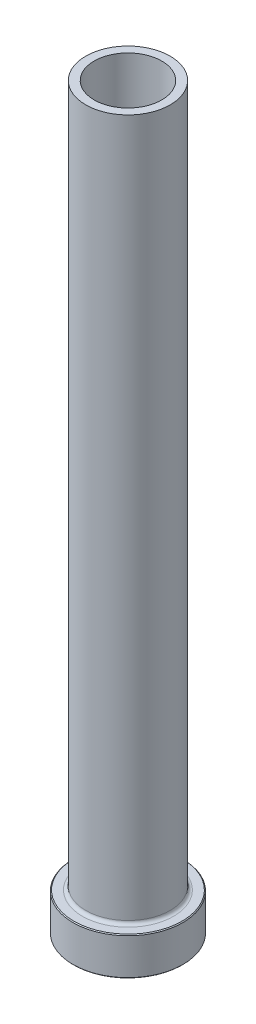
from build123d import *

# Parameters (mm, degrees)
FILLET1_R     = 0.8
CHAMFER1_SIZE = 0.2
CHAMFER3_SIZE = 0.5


with BuildPart() as part:
    # Sketch1 → Revolve1 (revolve)
    with BuildSketch(Plane.XY, mode=Mode.PRIVATE) as revolve1_sk:
        Polygon((-8, 175), (-10, 175), (-10, 9), (-13, 9), (-13, 0), (-8.25, 0), (-8.25, 108), (-8, 120), align=None)
    revolve(revolve1_sk.sketch.rotate(Axis((0, 92.187680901, 0), (0, -1, 0)), 270), axis=Axis((0, 92.187680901, 0), (0, -1, 0)))

    # Fillet1
    fillet1_edges = [part.edges().sort_by_distance(p)[0] for p in [
        (0, 9, -10),
    ]]
    fillet(fillet1_edges, radius=FILLET1_R)

    # Chamfer1
    chamfer1_edges = [part.edges().sort_by_distance(p)[0] for p in [
        (0, 0, -13),
        (0, 9, -13),
    ]]
    chamfer(chamfer1_edges, length=CHAMFER1_SIZE)

    # Chamfer3
    chamfer3_edges = [part.edges().sort_by_distance(p)[0] for p in [
        (0, 0, -8.25),
    ]]
    chamfer(chamfer3_edges, length=CHAMFER3_SIZE)


solid = part.part
